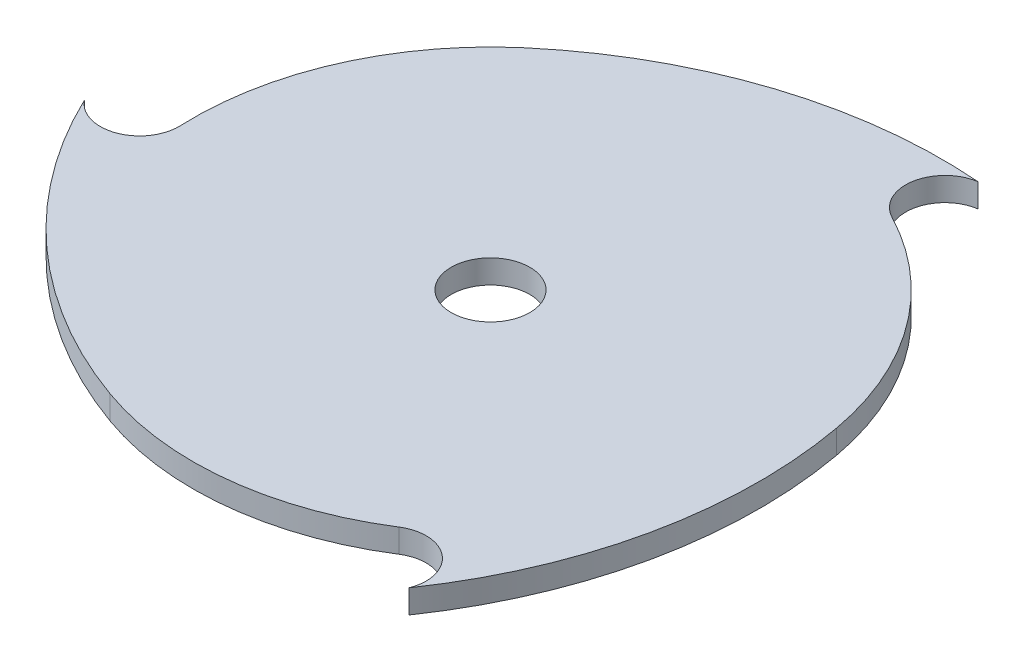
from build123d import *

# Parameters (mm, degrees)
SKETCH1_R           = 5
BOSS_EXTRUDE1_DEPTH = 3


with BuildPart() as part:
    # Sketch1 → Boss-Extrude1 (new body)
    with BuildSketch(Plane(origin=(0, 0, 0), x_dir=(1, 0, 0), z_dir=(0, 1, 0))):
        with BuildLine():
            ThreePointArc((19.081587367, 42.924859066), (-4.104188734, 40.206257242), (-24.497486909, 28.844725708))
            ThreePointArc((-24.497486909, 28.844725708), (-34.675430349, 15.157822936), (-37.809506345, -1.608196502))
            ThreePointArc((-37.809506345, -1.608196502), (-41.054166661, -6.504116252), (-46.714812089, -4.937290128))
            ThreePointArc((-46.714812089, -4.937290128), (-32.767545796, -23.657460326), (-12.731521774, -35.637808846))
            ThreePointArc((-12.731521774, -35.637808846), (4.210655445, -37.608715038), (20.297492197, -31.939894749))
            ThreePointArc((20.297492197, -31.939894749), (26.159813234, -32.301893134), (27.633224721, -37.987568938))
            ThreePointArc((27.633224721, -37.987568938), (36.359773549, -18.737088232), (37.869563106, 2.344994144))
            ThreePointArc((37.869563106, 2.344994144), (37.590945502, 4.575037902), (37.229008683, 6.793083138))
            ThreePointArc((37.229008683, 6.793083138), (32.173396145, 19.925301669), (22.669354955, 30.302564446))
            ThreePointArc((22.669354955, 30.302564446), (20.156114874, 32.029300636), (17.512014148, 33.54809125))
            ThreePointArc((17.512014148, 33.54809125), (14.894353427, 38.806009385), (19.081587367, 42.924859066))
        make_face()
        with Locations(Location((0, 0, 0), (0, 0, 270))):
            Circle(SKETCH1_R, mode=Mode.SUBTRACT)
    extrude(amount=BOSS_EXTRUDE1_DEPTH)


solid = part.part
